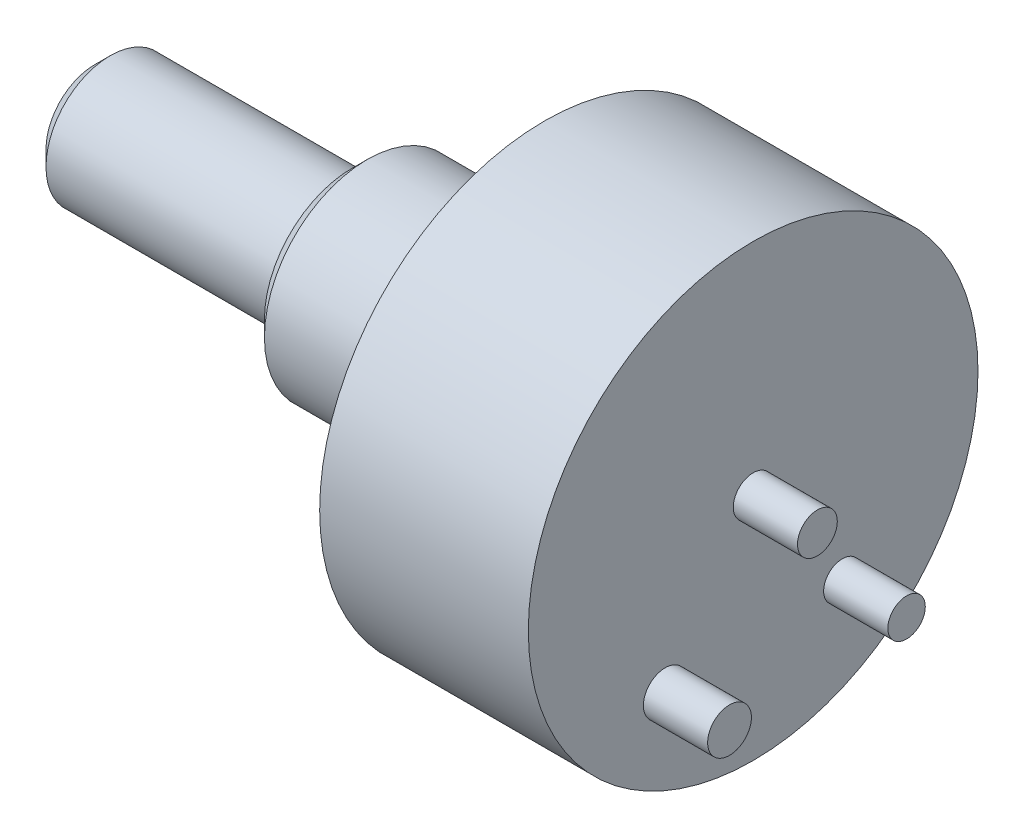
ISO-10303-21;
HEADER;
FILE_DESCRIPTION(('STEP AP214'),'2;1');
FILE_NAME('part.step','',(''),(''),'','','');
FILE_SCHEMA(('AUTOMOTIVE_DESIGN { 1 0 10303 214 1 1 1 1 }'));
ENDSEC;
DATA;
#1=APPLICATION_CONTEXT('core data for automotive mechanical design processes');
#2=APPLICATION_PROTOCOL_DEFINITION('international standard','automotive_design',2000,#1);
#3=PRODUCT_CONTEXT('',#1,'mechanical');
#4=PRODUCT('Part','Part','',(#3));
#5=PRODUCT_RELATED_PRODUCT_CATEGORY('part','',(#4));
#6=PRODUCT_DEFINITION_FORMATION('','',#4);
#7=PRODUCT_DEFINITION_CONTEXT('part definition',#1,'design');
#8=PRODUCT_DEFINITION('design','',#6,#7);
#9=PRODUCT_DEFINITION_SHAPE('','',#8);
#10=(LENGTH_UNIT() NAMED_UNIT(*) SI_UNIT(.MILLI.,.METRE.));
#11=(NAMED_UNIT(*) PLANE_ANGLE_UNIT() SI_UNIT($,.RADIAN.));
#12=(NAMED_UNIT(*) SI_UNIT($,.STERADIAN.) SOLID_ANGLE_UNIT());
#13=UNCERTAINTY_MEASURE_WITH_UNIT(LENGTH_MEASURE(1.E-05),#10,'distance_accuracy_value','');
#14=(GEOMETRIC_REPRESENTATION_CONTEXT(3) GLOBAL_UNCERTAINTY_ASSIGNED_CONTEXT((#13)) GLOBAL_UNIT_ASSIGNED_CONTEXT((#10,
#11,#12)) REPRESENTATION_CONTEXT('',''));
#15=CARTESIAN_POINT('',(0.,0.,0.));
#16=DIRECTION('',(0.,0.,1.));
#17=DIRECTION('',(1.,0.,0.));
#18=AXIS2_PLACEMENT_3D('',#15,#16,#17);
#19=CARTESIAN_POINT('',(0.,0.,0.));
#20=DIRECTION('',(1.,0.,0.));
#21=DIRECTION('',(0.,0.,-1.));
#22=AXIS2_PLACEMENT_3D('',#19,#20,#21);
#23=PLANE('',#22);
#24=CARTESIAN_POINT('',(0.,-5.60080183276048,-4.40744916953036));
#25=DIRECTION('',(1.,0.,0.));
#26=DIRECTION('',(0.,0.,-1.));
#27=AXIS2_PLACEMENT_3D('',#24,#25,#26);
#28=CIRCLE('',#27,0.925051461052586);
#29=CARTESIAN_POINT('',(0.,-5.60080183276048,-5.33250063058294));
#30=VERTEX_POINT('',#29);
#31=EDGE_CURVE('E73',#30,#30,#28,.T.);
#32=ORIENTED_EDGE('',*,*,#31,.F.);
#33=EDGE_LOOP('',(#32));
#34=FACE_BOUND('',#33,.T.);
#35=CARTESIAN_POINT('',(0.,0.,0.));
#36=DIRECTION('',(1.,0.,0.));
#37=DIRECTION('',(0.,0.,-1.));
#38=AXIS2_PLACEMENT_3D('',#35,#36,#37);
#39=CIRCLE('',#38,11.1125);
#40=CARTESIAN_POINT('',(0.,0.,-11.1125));
#41=VERTEX_POINT('',#40);
#42=EDGE_CURVE('E46',#41,#41,#39,.T.);
#43=ORIENTED_EDGE('',*,*,#42,.T.);
#44=EDGE_LOOP('',(#43));
#45=FACE_BOUND('',#44,.T.);
#46=CARTESIAN_POINT('',(0.,0.222759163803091,0.));
#47=DIRECTION('',(1.,0.,0.));
#48=DIRECTION('',(0.,0.,-1.));
#49=AXIS2_PLACEMENT_3D('',#46,#47,#48);
#50=CIRCLE('',#49,0.984063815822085);
#51=CARTESIAN_POINT('',(0.,0.222759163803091,-0.984063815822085));
#52=VERTEX_POINT('',#51);
#53=EDGE_CURVE('E67',#52,#52,#50,.T.);
#54=ORIENTED_EDGE('',*,*,#53,.F.);
#55=EDGE_LOOP('',(#54));
#56=FACE_BOUND('',#55,.T.);
#57=CARTESIAN_POINT('',(0.,-6.04632016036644,4.34380369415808));
#58=DIRECTION('',(1.,0.,0.));
#59=DIRECTION('',(0.,0.,-1.));
#60=AXIS2_PLACEMENT_3D('',#57,#58,#59);
#61=CIRCLE('',#60,1.08197308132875);
#62=CARTESIAN_POINT('',(0.,-6.04632016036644,3.26183061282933));
#63=VERTEX_POINT('',#62);
#64=EDGE_CURVE('E79',#63,#63,#61,.T.);
#65=ORIENTED_EDGE('',*,*,#64,.F.);
#66=EDGE_LOOP('',(#65));
#67=FACE_BOUND('',#66,.T.);
#68=ADVANCED_FACE('F27',(#34,#45,#56,#67),#23,.T.);
#69=CARTESIAN_POINT('',(0.,0.,0.));
#70=DIRECTION('',(1.,0.,0.));
#71=DIRECTION('',(0.,0.,-1.));
#72=AXIS2_PLACEMENT_3D('',#69,#70,#71);
#73=CYLINDRICAL_SURFACE('',#72,11.1125);
#74=CARTESIAN_POINT('',(-10.3124,0.,0.));
#75=DIRECTION('',(1.,0.,0.));
#76=DIRECTION('',(0.,0.,-1.));
#77=AXIS2_PLACEMENT_3D('',#74,#75,#76);
#78=CIRCLE('',#77,11.1125);
#79=CARTESIAN_POINT('',(-10.3124,0.,-11.1125));
#80=VERTEX_POINT('',#79);
#81=EDGE_CURVE('E49',#80,#80,#78,.T.);
#82=ORIENTED_EDGE('',*,*,#81,.T.);
#83=EDGE_LOOP('',(#82));
#84=FACE_BOUND('',#83,.T.);
#85=ORIENTED_EDGE('',*,*,#42,.F.);
#86=EDGE_LOOP('',(#85));
#87=FACE_BOUND('',#86,.T.);
#88=ADVANCED_FACE('F86',(#84,#87),#73,.T.);
#89=CARTESIAN_POINT('',(-10.3124,11.1125,0.));
#90=DIRECTION('',(-1.,0.,0.));
#91=DIRECTION('',(0.,0.,1.));
#92=AXIS2_PLACEMENT_3D('',#89,#90,#91);
#93=PLANE('',#92);
#94=CARTESIAN_POINT('',(-10.3124,0.,0.));
#95=DIRECTION('',(1.,0.,0.));
#96=DIRECTION('',(0.,0.,-1.));
#97=AXIS2_PLACEMENT_3D('',#94,#95,#96);
#98=CIRCLE('',#97,5.207);
#99=CARTESIAN_POINT('',(-10.3124,0.,-5.207));
#100=VERTEX_POINT('',#99);
#101=EDGE_CURVE('E52',#100,#100,#98,.T.);
#102=ORIENTED_EDGE('',*,*,#101,.T.);
#103=EDGE_LOOP('',(#102));
#104=FACE_BOUND('',#103,.T.);
#105=ORIENTED_EDGE('',*,*,#81,.F.);
#106=EDGE_LOOP('',(#105));
#107=FACE_BOUND('',#106,.T.);
#108=ADVANCED_FACE('F93',(#104,#107),#93,.T.);
#109=CARTESIAN_POINT('',(0.,0.,0.));
#110=DIRECTION('',(1.,0.,0.));
#111=DIRECTION('',(0.,0.,-1.));
#112=AXIS2_PLACEMENT_3D('',#109,#110,#111);
#113=CYLINDRICAL_SURFACE('',#112,5.207);
#114=CARTESIAN_POINT('',(-11.8364,0.,0.));
#115=DIRECTION('',(1.,0.,0.));
#116=DIRECTION('',(0.,0.,-1.));
#117=AXIS2_PLACEMENT_3D('',#114,#115,#116);
#118=CIRCLE('',#117,5.207);
#119=CARTESIAN_POINT('',(-11.8364,0.,-5.207));
#120=VERTEX_POINT('',#119);
#121=EDGE_CURVE('E55',#120,#120,#118,.T.);
#122=ORIENTED_EDGE('',*,*,#121,.T.);
#123=EDGE_LOOP('',(#122));
#124=FACE_BOUND('',#123,.T.);
#125=ORIENTED_EDGE('',*,*,#101,.F.);
#126=EDGE_LOOP('',(#125));
#127=FACE_BOUND('',#126,.T.);
#128=ADVANCED_FACE('F138',(#124,#127),#113,.T.);
#129=CARTESIAN_POINT('',(-11.8364,5.207,0.));
#130=DIRECTION('',(-1.,0.,0.));
#131=DIRECTION('',(0.,0.,1.));
#132=AXIS2_PLACEMENT_3D('',#129,#130,#131);
#133=PLANE('',#132);
#134=CARTESIAN_POINT('',(-11.8364,0.,0.));
#135=DIRECTION('',(1.,0.,0.));
#136=DIRECTION('',(0.,0.,-1.));
#137=AXIS2_PLACEMENT_3D('',#134,#135,#136);
#138=CIRCLE('',#137,5.08);
#139=CARTESIAN_POINT('',(-11.8364,0.,-5.08));
#140=VERTEX_POINT('',#139);
#141=EDGE_CURVE('E58',#140,#140,#138,.T.);
#142=ORIENTED_EDGE('',*,*,#141,.T.);
#143=EDGE_LOOP('',(#142));
#144=FACE_BOUND('',#143,.T.);
#145=ORIENTED_EDGE('',*,*,#121,.F.);
#146=EDGE_LOOP('',(#145));
#147=FACE_BOUND('',#146,.T.);
#148=ADVANCED_FACE('F135',(#144,#147),#133,.T.);
#149=CARTESIAN_POINT('',(0.,0.,0.));
#150=DIRECTION('',(1.,0.,0.));
#151=DIRECTION('',(0.,0.,-1.));
#152=AXIS2_PLACEMENT_3D('',#149,#150,#151);
#153=CYLINDRICAL_SURFACE('',#152,5.08);
#154=CARTESIAN_POINT('',(-19.0754,0.,0.));
#155=DIRECTION('',(-1.,0.,0.));
#156=DIRECTION('',(0.,0.,1.));
#157=AXIS2_PLACEMENT_3D('',#154,#155,#156);
#158=CIRCLE('',#157,5.08);
#159=CARTESIAN_POINT('',(-19.0754,0.,5.08));
#160=VERTEX_POINT('',#159);
#161=EDGE_CURVE('E33',#160,#160,#158,.F.);
#162=ORIENTED_EDGE('',*,*,#161,.T.);
#163=EDGE_LOOP('',(#162));
#164=FACE_BOUND('',#163,.T.);
#165=ORIENTED_EDGE('',*,*,#141,.F.);
#166=EDGE_LOOP('',(#165));
#167=FACE_BOUND('',#166,.T.);
#168=ADVANCED_FACE('F132',(#164,#167),#153,.T.);
#169=CARTESIAN_POINT('',(-19.8374,5.08,0.));
#170=DIRECTION('',(-1.,0.,0.));
#171=DIRECTION('',(0.,0.,1.));
#172=AXIS2_PLACEMENT_3D('',#169,#170,#171);
#173=PLANE('',#172);
#174=CARTESIAN_POINT('',(-19.8374,0.,0.));
#175=DIRECTION('',(-1.,0.,0.));
#176=DIRECTION('',(0.,0.,1.));
#177=AXIS2_PLACEMENT_3D('',#174,#175,#176);
#178=CIRCLE('',#177,4.31799999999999);
#179=CARTESIAN_POINT('',(-19.8374,0.,4.31799999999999));
#180=VERTEX_POINT('',#179);
#181=EDGE_CURVE('E10',#180,#180,#178,.T.);
#182=ORIENTED_EDGE('',*,*,#181,.T.);
#183=EDGE_LOOP('',(#182));
#184=FACE_BOUND('',#183,.T.);
#185=CARTESIAN_POINT('',(-19.8374,0.,0.));
#186=DIRECTION('',(1.,0.,0.));
#187=DIRECTION('',(0.,0.,-1.));
#188=AXIS2_PLACEMENT_3D('',#185,#186,#187);
#189=CIRCLE('',#188,3.175);
#190=CARTESIAN_POINT('',(-19.8374,0.,-3.175));
#191=VERTEX_POINT('',#190);
#192=EDGE_CURVE('E61',#191,#191,#189,.T.);
#193=ORIENTED_EDGE('',*,*,#192,.T.);
#194=EDGE_LOOP('',(#193));
#195=FACE_BOUND('',#194,.T.);
#196=ADVANCED_FACE('F128',(#184,#195),#173,.T.);
#197=CARTESIAN_POINT('',(0.,0.,0.));
#198=DIRECTION('',(1.,0.,0.));
#199=DIRECTION('',(0.,0.,-1.));
#200=AXIS2_PLACEMENT_3D('',#197,#198,#199);
#201=CYLINDRICAL_SURFACE('',#200,3.175);
#202=CARTESIAN_POINT('',(-31.7754,0.,0.));
#203=DIRECTION('',(-1.,0.,0.));
#204=DIRECTION('',(0.,0.,1.));
#205=AXIS2_PLACEMENT_3D('',#202,#203,#204);
#206=CIRCLE('',#205,3.175);
#207=CARTESIAN_POINT('',(-31.7754,0.,3.175));
#208=VERTEX_POINT('',#207);
#209=EDGE_CURVE('E41',#208,#208,#206,.F.);
#210=ORIENTED_EDGE('',*,*,#209,.T.);
#211=EDGE_LOOP('',(#210));
#212=FACE_BOUND('',#211,.T.);
#213=ORIENTED_EDGE('',*,*,#192,.F.);
#214=EDGE_LOOP('',(#213));
#215=FACE_BOUND('',#214,.T.);
#216=ADVANCED_FACE('F124',(#212,#215),#201,.T.);
#217=CARTESIAN_POINT('',(-32.5374,3.175,0.));
#218=DIRECTION('',(-1.,0.,0.));
#219=DIRECTION('',(0.,0.,1.));
#220=AXIS2_PLACEMENT_3D('',#217,#218,#219);
#221=PLANE('',#220);
#222=CARTESIAN_POINT('',(-32.5374,0.,0.));
#223=DIRECTION('',(-1.,0.,0.));
#224=DIRECTION('',(0.,0.,1.));
#225=AXIS2_PLACEMENT_3D('',#222,#223,#224);
#226=CIRCLE('',#225,2.41300000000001);
#227=CARTESIAN_POINT('',(-32.5374,0.,2.41300000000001));
#228=VERTEX_POINT('',#227);
#229=EDGE_CURVE('E37',#228,#228,#226,.T.);
#230=ORIENTED_EDGE('',*,*,#229,.T.);
#231=EDGE_LOOP('',(#230));
#232=FACE_BOUND('',#231,.T.);
#233=ADVANCED_FACE('F120',(#232),#221,.T.);
#234=CARTESIAN_POINT('',(-31.7754,0.,0.));
#235=DIRECTION('',(1.,0.,0.));
#236=DIRECTION('',(0.,0.,-1.));
#237=AXIS2_PLACEMENT_3D('',#234,#235,#236);
#238=CONICAL_SURFACE('',#237,3.175,0.785398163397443);
#239=ORIENTED_EDGE('',*,*,#229,.F.);
#240=EDGE_LOOP('',(#239));
#241=FACE_BOUND('',#240,.T.);
#242=ORIENTED_EDGE('',*,*,#209,.F.);
#243=EDGE_LOOP('',(#242));
#244=FACE_BOUND('',#243,.T.);
#245=ADVANCED_FACE('F112',(#241,#244),#238,.T.);
#246=CARTESIAN_POINT('',(-19.0754,0.,0.));
#247=DIRECTION('',(1.,0.,0.));
#248=DIRECTION('',(0.,0.,-1.));
#249=AXIS2_PLACEMENT_3D('',#246,#247,#248);
#250=CONICAL_SURFACE('',#249,5.08,0.785398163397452);
#251=ORIENTED_EDGE('',*,*,#181,.F.);
#252=EDGE_LOOP('',(#251));
#253=FACE_BOUND('',#252,.T.);
#254=ORIENTED_EDGE('',*,*,#161,.F.);
#255=EDGE_LOOP('',(#254));
#256=FACE_BOUND('',#255,.T.);
#257=ADVANCED_FACE('F103',(#253,#256),#250,.T.);
#258=CARTESIAN_POINT('',(3.175,0.222759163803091,0.));
#259=DIRECTION('',(-1.,0.,0.));
#260=DIRECTION('',(0.,0.,1.));
#261=AXIS2_PLACEMENT_3D('',#258,#259,#260);
#262=CYLINDRICAL_SURFACE('',#261,0.984063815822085);
#263=CARTESIAN_POINT('',(3.175,0.222759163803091,0.));
#264=DIRECTION('',(1.,0.,0.));
#265=DIRECTION('',(0.,0.,-1.));
#266=AXIS2_PLACEMENT_3D('',#263,#264,#265);
#267=CIRCLE('',#266,0.984063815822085);
#268=CARTESIAN_POINT('',(3.175,0.222759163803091,-0.984063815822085));
#269=VERTEX_POINT('',#268);
#270=EDGE_CURVE('E64',#269,#269,#267,.T.);
#271=ORIENTED_EDGE('',*,*,#270,.F.);
#272=EDGE_LOOP('',(#271));
#273=FACE_BOUND('',#272,.T.);
#274=ORIENTED_EDGE('',*,*,#53,.T.);
#275=EDGE_LOOP('',(#274));
#276=FACE_BOUND('',#275,.T.);
#277=ADVANCED_FACE('F101',(#273,#276),#262,.T.);
#278=CARTESIAN_POINT('',(3.175,0.222759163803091,0.));
#279=DIRECTION('',(1.,0.,0.));
#280=DIRECTION('',(0.,0.,-1.));
#281=AXIS2_PLACEMENT_3D('',#278,#279,#280);
#282=PLANE('',#281);
#283=ORIENTED_EDGE('',*,*,#270,.T.);
#284=EDGE_LOOP('',(#283));
#285=FACE_BOUND('',#284,.T.);
#286=ADVANCED_FACE('F102',(#285),#282,.T.);
#287=CARTESIAN_POINT('',(3.175,-5.60080183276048,-4.40744916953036));
#288=DIRECTION('',(-1.,0.,0.));
#289=DIRECTION('',(0.,0.,1.));
#290=AXIS2_PLACEMENT_3D('',#287,#288,#289);
#291=CYLINDRICAL_SURFACE('',#290,0.925051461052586);
#292=CARTESIAN_POINT('',(3.175,-5.60080183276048,-4.40744916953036));
#293=DIRECTION('',(1.,0.,0.));
#294=DIRECTION('',(0.,0.,-1.));
#295=AXIS2_PLACEMENT_3D('',#292,#293,#294);
#296=CIRCLE('',#295,0.925051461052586);
#297=CARTESIAN_POINT('',(3.175,-5.60080183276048,-5.33250063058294));
#298=VERTEX_POINT('',#297);
#299=EDGE_CURVE('E70',#298,#298,#296,.T.);
#300=ORIENTED_EDGE('',*,*,#299,.F.);
#301=EDGE_LOOP('',(#300));
#302=FACE_BOUND('',#301,.T.);
#303=ORIENTED_EDGE('',*,*,#31,.T.);
#304=EDGE_LOOP('',(#303));
#305=FACE_BOUND('',#304,.T.);
#306=ADVANCED_FACE('F109',(#302,#305),#291,.T.);
#307=CARTESIAN_POINT('',(3.175,-5.60080183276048,-4.40744916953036));
#308=DIRECTION('',(1.,0.,0.));
#309=DIRECTION('',(0.,0.,-1.));
#310=AXIS2_PLACEMENT_3D('',#307,#308,#309);
#311=PLANE('',#310);
#312=ORIENTED_EDGE('',*,*,#299,.T.);
#313=EDGE_LOOP('',(#312));
#314=FACE_BOUND('',#313,.T.);
#315=ADVANCED_FACE('F201',(#314),#311,.T.);
#316=CARTESIAN_POINT('',(3.175,-6.04632016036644,4.34380369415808));
#317=DIRECTION('',(-1.,0.,0.));
#318=DIRECTION('',(0.,0.,1.));
#319=AXIS2_PLACEMENT_3D('',#316,#317,#318);
#320=CYLINDRICAL_SURFACE('',#319,1.08197308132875);
#321=CARTESIAN_POINT('',(3.175,-6.04632016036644,4.34380369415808));
#322=DIRECTION('',(1.,0.,0.));
#323=DIRECTION('',(0.,0.,-1.));
#324=AXIS2_PLACEMENT_3D('',#321,#322,#323);
#325=CIRCLE('',#324,1.08197308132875);
#326=CARTESIAN_POINT('',(3.175,-6.04632016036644,3.26183061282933));
#327=VERTEX_POINT('',#326);
#328=EDGE_CURVE('E76',#327,#327,#325,.T.);
#329=ORIENTED_EDGE('',*,*,#328,.F.);
#330=EDGE_LOOP('',(#329));
#331=FACE_BOUND('',#330,.T.);
#332=ORIENTED_EDGE('',*,*,#64,.T.);
#333=EDGE_LOOP('',(#332));
#334=FACE_BOUND('',#333,.T.);
#335=ADVANCED_FACE('F83',(#331,#334),#320,.T.);
#336=CARTESIAN_POINT('',(3.175,-6.04632016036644,4.34380369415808));
#337=DIRECTION('',(1.,0.,0.));
#338=DIRECTION('',(0.,0.,-1.));
#339=AXIS2_PLACEMENT_3D('',#336,#337,#338);
#340=PLANE('',#339);
#341=ORIENTED_EDGE('',*,*,#328,.T.);
#342=EDGE_LOOP('',(#341));
#343=FACE_BOUND('',#342,.T.);
#344=ADVANCED_FACE('F215',(#343),#340,.T.);
#345=CLOSED_SHELL('',(#68,#88,#108,#128,#148,#168,#196,#216,#233,#245,#257,#277,#286,#306,#315,
#335,#344));
#346=MANIFOLD_SOLID_BREP('B2',#345);
#347=ADVANCED_BREP_SHAPE_REPRESENTATION('',(#18,#346),#14);
#348=SHAPE_DEFINITION_REPRESENTATION(#9,#347);
ENDSEC;
END-ISO-10303-21;
